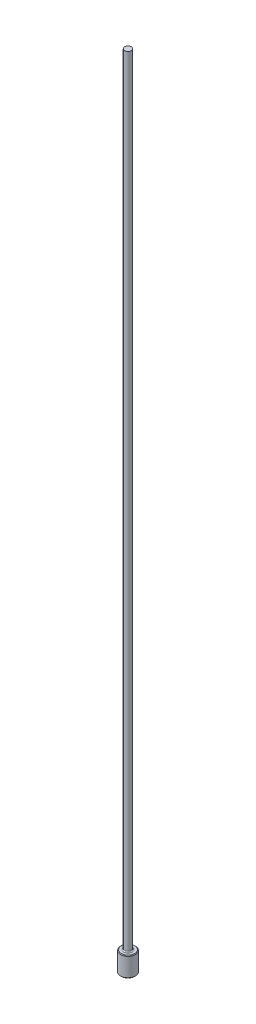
from build123d import *

# Parameters (mm, degrees)
CHAMFER1_SIZE = 0.0508
FILLET1_R     = 0.0762


with BuildPart() as part:
    # Sketch1 → Revolve1 (revolve)
    with BuildSketch(Plane.XY, mode=Mode.PRIVATE) as revolve1_sk:
        Polygon((0, 0), (-0.5842, 0), (-0.5842, 1.5748), (-0.2667, 1.5748), (-0.2667, 63.5), (0, 63.5), align=None)
    revolve(revolve1_sk.sketch.rotate(Axis((0, 259.958771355, 0), (0, -1, 0)), 270), axis=Axis((0, 259.958771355, 0), (0, -1, 0)))

    # Chamfer1
    chamfer1_edges = [part.edges().sort_by_distance(p)[0] for p in [
        (0, 1.5748, -0.5842),
        (0, 0, -0.5842),
    ]]
    chamfer(chamfer1_edges, length=CHAMFER1_SIZE)

    # Fillet1
    fillet1_edges = [part.edges().sort_by_distance(p)[0] for p in [
        (0, 1.5748, -0.2667),
    ]]
    fillet(fillet1_edges, radius=FILLET1_R)


solid = part.part
